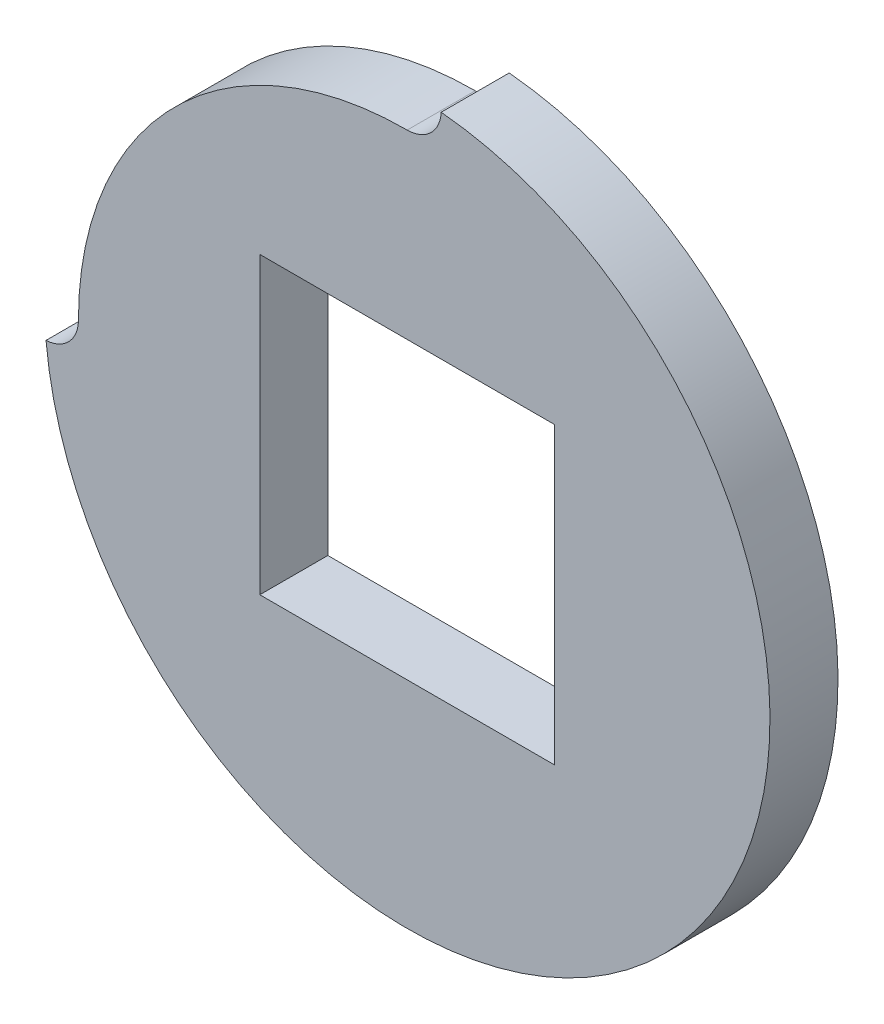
ISO-10303-21;
HEADER;
FILE_DESCRIPTION(('STEP AP214'),'2;1');
FILE_NAME('part.step','',(''),(''),'','','');
FILE_SCHEMA(('AUTOMOTIVE_DESIGN { 1 0 10303 214 1 1 1 1 }'));
ENDSEC;
DATA;
#1=APPLICATION_CONTEXT('core data for automotive mechanical design processes');
#2=APPLICATION_PROTOCOL_DEFINITION('international standard','automotive_design',2000,#1);
#3=PRODUCT_CONTEXT('',#1,'mechanical');
#4=PRODUCT('Part','Part','',(#3));
#5=PRODUCT_RELATED_PRODUCT_CATEGORY('part','',(#4));
#6=PRODUCT_DEFINITION_FORMATION('','',#4);
#7=PRODUCT_DEFINITION_CONTEXT('part definition',#1,'design');
#8=PRODUCT_DEFINITION('design','',#6,#7);
#9=PRODUCT_DEFINITION_SHAPE('','',#8);
#10=(LENGTH_UNIT() NAMED_UNIT(*) SI_UNIT(.MILLI.,.METRE.));
#11=(NAMED_UNIT(*) PLANE_ANGLE_UNIT() SI_UNIT($,.RADIAN.));
#12=(NAMED_UNIT(*) SI_UNIT($,.STERADIAN.) SOLID_ANGLE_UNIT());
#13=UNCERTAINTY_MEASURE_WITH_UNIT(LENGTH_MEASURE(1.E-05),#10,'distance_accuracy_value','');
#14=(GEOMETRIC_REPRESENTATION_CONTEXT(3) GLOBAL_UNCERTAINTY_ASSIGNED_CONTEXT((#13)) GLOBAL_UNIT_ASSIGNED_CONTEXT((#10,
#11,#12)) REPRESENTATION_CONTEXT('',''));
#15=CARTESIAN_POINT('',(0.,0.,0.));
#16=DIRECTION('',(0.,0.,1.));
#17=DIRECTION('',(1.,0.,0.));
#18=AXIS2_PLACEMENT_3D('',#15,#16,#17);
#19=CARTESIAN_POINT('',(0.,8.00000000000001,3.));
#20=DIRECTION('',(0.,0.,1.));
#21=DIRECTION('',(1.,0.,0.));
#22=AXIS2_PLACEMENT_3D('',#19,#20,#21);
#23=PLANE('',#22);
#24=CARTESIAN_POINT('',(0.,16.,3.));
#25=DIRECTION('',(0.,0.,1.));
#26=DIRECTION('',(1.,0.,0.));
#27=AXIS2_PLACEMENT_3D('',#24,#25,#26);
#28=CIRCLE('',#27,1.49999999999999);
#29=CARTESIAN_POINT('',(0.,14.5,3.));
#30=VERTEX_POINT('',#29);
#31=CARTESIAN_POINT('',(1.49835114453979,15.9296875,3.));
#32=VERTEX_POINT('',#31);
#33=EDGE_CURVE('E142',#30,#32,#28,.T.);
#34=ORIENTED_EDGE('',*,*,#33,.F.);
#35=CARTESIAN_POINT('',(0.,0.,3.));
#36=DIRECTION('',(0.,0.,1.));
#37=DIRECTION('',(1.,0.,0.));
#38=AXIS2_PLACEMENT_3D('',#35,#36,#37);
#39=CIRCLE('',#38,14.5);
#40=CARTESIAN_POINT('',(-14.5,0.,3.));
#41=VERTEX_POINT('',#40);
#42=EDGE_CURVE('E151',#30,#41,#39,.T.);
#43=ORIENTED_EDGE('',*,*,#42,.T.);
#44=CARTESIAN_POINT('',(-16.,0.,3.));
#45=DIRECTION('',(0.,0.,1.));
#46=DIRECTION('',(1.,0.,0.));
#47=AXIS2_PLACEMENT_3D('',#44,#45,#46);
#48=CIRCLE('',#47,1.49999999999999);
#49=CARTESIAN_POINT('',(-15.9296875,-1.49835114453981,3.));
#50=VERTEX_POINT('',#49);
#51=EDGE_CURVE('E148',#50,#41,#48,.T.);
#52=ORIENTED_EDGE('',*,*,#51,.F.);
#53=CARTESIAN_POINT('',(0.,0.,3.));
#54=DIRECTION('',(0.,0.,1.));
#55=DIRECTION('',(1.,0.,0.));
#56=AXIS2_PLACEMENT_3D('',#53,#54,#55);
#57=CIRCLE('',#56,16.);
#58=EDGE_CURVE('E145',#50,#32,#57,.T.);
#59=ORIENTED_EDGE('',*,*,#58,.T.);
#60=EDGE_LOOP('',(#34,#43,#52,#59));
#61=FACE_BOUND('',#60,.T.);
#62=DIRECTION('',(-1.,0.,0.));
#63=VECTOR('',#62,1.);
#64=CARTESIAN_POINT('',(6.50000000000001,-6.5,2.99999999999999));
#65=LINE('',#64,#63);
#66=CARTESIAN_POINT('',(6.50000000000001,-6.5,2.99999999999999));
#67=VERTEX_POINT('',#66);
#68=CARTESIAN_POINT('',(-6.50000000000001,-6.50000000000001,2.99999999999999));
#69=VERTEX_POINT('',#68);
#70=EDGE_CURVE('E120',#67,#69,#65,.T.);
#71=ORIENTED_EDGE('',*,*,#70,.T.);
#72=DIRECTION('',(0.,-1.,0.));
#73=VECTOR('',#72,1.);
#74=CARTESIAN_POINT('',(-6.5,6.5,3.));
#75=LINE('',#74,#73);
#76=CARTESIAN_POINT('',(-6.5,6.5,3.));
#77=VERTEX_POINT('',#76);
#78=EDGE_CURVE('E96',#77,#69,#75,.T.);
#79=ORIENTED_EDGE('',*,*,#78,.F.);
#80=DIRECTION('',(1.,0.,0.));
#81=VECTOR('',#80,1.);
#82=CARTESIAN_POINT('',(-6.5,6.5,3.));
#83=LINE('',#82,#81);
#84=CARTESIAN_POINT('',(6.50000000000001,6.50000000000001,3.00000000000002));
#85=VERTEX_POINT('',#84);
#86=EDGE_CURVE('E123',#77,#85,#83,.T.);
#87=ORIENTED_EDGE('',*,*,#86,.T.);
#88=DIRECTION('',(0.,1.,0.));
#89=VECTOR('',#88,1.);
#90=CARTESIAN_POINT('',(6.50000000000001,-6.5,2.99999999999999));
#91=LINE('',#90,#89);
#92=EDGE_CURVE('E45',#67,#85,#91,.T.);
#93=ORIENTED_EDGE('',*,*,#92,.F.);
#94=EDGE_LOOP('',(#71,#79,#87,#93));
#95=FACE_BOUND('',#94,.T.);
#96=ADVANCED_FACE('F30',(#61,#95),#23,.T.);
#97=CARTESIAN_POINT('',(0.,8.00000000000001,0.));
#98=DIRECTION('',(0.,0.,1.));
#99=DIRECTION('',(1.,0.,0.));
#100=AXIS2_PLACEMENT_3D('',#97,#98,#99);
#101=PLANE('',#100);
#102=CARTESIAN_POINT('',(0.,16.,0.));
#103=DIRECTION('',(0.,0.,1.));
#104=DIRECTION('',(1.,0.,0.));
#105=AXIS2_PLACEMENT_3D('',#102,#103,#104);
#106=CIRCLE('',#105,1.49999999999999);
#107=CARTESIAN_POINT('',(0.,14.5,0.));
#108=VERTEX_POINT('',#107);
#109=CARTESIAN_POINT('',(1.49835114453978,15.9296875,0.));
#110=VERTEX_POINT('',#109);
#111=EDGE_CURVE('E100',#108,#110,#106,.T.);
#112=ORIENTED_EDGE('',*,*,#111,.T.);
#113=CARTESIAN_POINT('',(0.,0.,0.));
#114=DIRECTION('',(0.,0.,1.));
#115=DIRECTION('',(1.,0.,0.));
#116=AXIS2_PLACEMENT_3D('',#113,#114,#115);
#117=CIRCLE('',#116,16.);
#118=CARTESIAN_POINT('',(-15.9296875,-1.49835114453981,0.));
#119=VERTEX_POINT('',#118);
#120=EDGE_CURVE('E133',#119,#110,#117,.T.);
#121=ORIENTED_EDGE('',*,*,#120,.F.);
#122=CARTESIAN_POINT('',(-16.,0.,0.));
#123=DIRECTION('',(0.,0.,1.));
#124=DIRECTION('',(1.,0.,0.));
#125=AXIS2_PLACEMENT_3D('',#122,#123,#124);
#126=CIRCLE('',#125,1.49999999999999);
#127=CARTESIAN_POINT('',(-14.5,0.,0.));
#128=VERTEX_POINT('',#127);
#129=EDGE_CURVE('E136',#119,#128,#126,.T.);
#130=ORIENTED_EDGE('',*,*,#129,.T.);
#131=CARTESIAN_POINT('',(0.,0.,0.));
#132=DIRECTION('',(0.,0.,1.));
#133=DIRECTION('',(1.,0.,0.));
#134=AXIS2_PLACEMENT_3D('',#131,#132,#133);
#135=CIRCLE('',#134,14.5);
#136=EDGE_CURVE('E139',#108,#128,#135,.T.);
#137=ORIENTED_EDGE('',*,*,#136,.F.);
#138=EDGE_LOOP('',(#112,#121,#130,#137));
#139=FACE_BOUND('',#138,.T.);
#140=DIRECTION('',(0.,-1.,0.));
#141=VECTOR('',#140,1.);
#142=CARTESIAN_POINT('',(-6.50000000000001,6.5,0.));
#143=LINE('',#142,#141);
#144=CARTESIAN_POINT('',(-6.50000000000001,6.5,0.));
#145=VERTEX_POINT('',#144);
#146=CARTESIAN_POINT('',(-6.50000000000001,-6.50000000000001,0.));
#147=VERTEX_POINT('',#146);
#148=EDGE_CURVE('E53',#145,#147,#143,.T.);
#149=ORIENTED_EDGE('',*,*,#148,.T.);
#150=DIRECTION('',(-1.,0.,0.));
#151=VECTOR('',#150,1.);
#152=CARTESIAN_POINT('',(6.50000000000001,-6.5,0.));
#153=LINE('',#152,#151);
#154=CARTESIAN_POINT('',(6.50000000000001,-6.5,0.));
#155=VERTEX_POINT('',#154);
#156=EDGE_CURVE('E104',#155,#147,#153,.T.);
#157=ORIENTED_EDGE('',*,*,#156,.F.);
#158=DIRECTION('',(0.,1.,0.));
#159=VECTOR('',#158,1.);
#160=CARTESIAN_POINT('',(6.50000000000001,-6.5,0.));
#161=LINE('',#160,#159);
#162=CARTESIAN_POINT('',(6.50000000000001,6.50000000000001,0.));
#163=VERTEX_POINT('',#162);
#164=EDGE_CURVE('E109',#155,#163,#161,.T.);
#165=ORIENTED_EDGE('',*,*,#164,.T.);
#166=DIRECTION('',(1.,0.,0.));
#167=VECTOR('',#166,1.);
#168=CARTESIAN_POINT('',(-6.50000000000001,6.5,0.));
#169=LINE('',#168,#167);
#170=EDGE_CURVE('E114',#145,#163,#169,.T.);
#171=ORIENTED_EDGE('',*,*,#170,.F.);
#172=EDGE_LOOP('',(#149,#157,#165,#171));
#173=FACE_BOUND('',#172,.T.);
#174=ADVANCED_FACE('F112',(#139,#173),#101,.F.);
#175=CARTESIAN_POINT('',(0.,16.,3.));
#176=DIRECTION('',(0.,0.,-1.));
#177=DIRECTION('',(-1.,0.,0.));
#178=AXIS2_PLACEMENT_3D('',#175,#176,#177);
#179=CYLINDRICAL_SURFACE('',#178,1.49999999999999);
#180=DIRECTION('',(0.,0.,-1.));
#181=VECTOR('',#180,1.);
#182=CARTESIAN_POINT('',(0.,14.5,3.));
#183=LINE('',#182,#181);
#184=EDGE_CURVE('E11',#30,#108,#183,.T.);
#185=ORIENTED_EDGE('',*,*,#184,.F.);
#186=ORIENTED_EDGE('',*,*,#33,.T.);
#187=DIRECTION('',(0.,0.,-1.));
#188=VECTOR('',#187,1.);
#189=CARTESIAN_POINT('',(1.49835114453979,15.9296875,3.));
#190=LINE('',#189,#188);
#191=EDGE_CURVE('E154',#32,#110,#190,.T.);
#192=ORIENTED_EDGE('',*,*,#191,.T.);
#193=ORIENTED_EDGE('',*,*,#111,.F.);
#194=EDGE_LOOP('',(#185,#186,#192,#193));
#195=FACE_BOUND('',#194,.T.);
#196=ADVANCED_FACE('F169',(#195),#179,.F.);
#197=CARTESIAN_POINT('',(0.,0.,3.));
#198=DIRECTION('',(0.,0.,-1.));
#199=DIRECTION('',(-1.,0.,0.));
#200=AXIS2_PLACEMENT_3D('',#197,#198,#199);
#201=CYLINDRICAL_SURFACE('',#200,14.5);
#202=DIRECTION('',(0.,0.,-1.));
#203=VECTOR('',#202,1.);
#204=CARTESIAN_POINT('',(-14.5,0.,3.));
#205=LINE('',#204,#203);
#206=EDGE_CURVE('E38',#41,#128,#205,.T.);
#207=ORIENTED_EDGE('',*,*,#206,.F.);
#208=ORIENTED_EDGE('',*,*,#42,.F.);
#209=ORIENTED_EDGE('',*,*,#184,.T.);
#210=ORIENTED_EDGE('',*,*,#136,.T.);
#211=EDGE_LOOP('',(#207,#208,#209,#210));
#212=FACE_BOUND('',#211,.T.);
#213=ADVANCED_FACE('F32',(#212),#201,.T.);
#214=CARTESIAN_POINT('',(-16.,0.,3.));
#215=DIRECTION('',(0.,0.,-1.));
#216=DIRECTION('',(-1.,0.,0.));
#217=AXIS2_PLACEMENT_3D('',#214,#215,#216);
#218=CYLINDRICAL_SURFACE('',#217,1.49999999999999);
#219=DIRECTION('',(0.,0.,-1.));
#220=VECTOR('',#219,1.);
#221=CARTESIAN_POINT('',(-15.9296875,-1.49835114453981,3.));
#222=LINE('',#221,#220);
#223=EDGE_CURVE('E156',#50,#119,#222,.T.);
#224=ORIENTED_EDGE('',*,*,#223,.F.);
#225=ORIENTED_EDGE('',*,*,#51,.T.);
#226=ORIENTED_EDGE('',*,*,#206,.T.);
#227=ORIENTED_EDGE('',*,*,#129,.F.);
#228=EDGE_LOOP('',(#224,#225,#226,#227));
#229=FACE_BOUND('',#228,.T.);
#230=ADVANCED_FACE('F159',(#229),#218,.F.);
#231=CARTESIAN_POINT('',(0.,0.,3.));
#232=DIRECTION('',(0.,0.,-1.));
#233=DIRECTION('',(-1.,0.,0.));
#234=AXIS2_PLACEMENT_3D('',#231,#232,#233);
#235=CYLINDRICAL_SURFACE('',#234,16.);
#236=ORIENTED_EDGE('',*,*,#58,.F.);
#237=ORIENTED_EDGE('',*,*,#223,.T.);
#238=ORIENTED_EDGE('',*,*,#120,.T.);
#239=ORIENTED_EDGE('',*,*,#191,.F.);
#240=EDGE_LOOP('',(#236,#237,#238,#239));
#241=FACE_BOUND('',#240,.T.);
#242=ADVANCED_FACE('F172',(#241),#235,.T.);
#243=CARTESIAN_POINT('',(-6.5,6.5,3.));
#244=DIRECTION('',(1.,0.,0.));
#245=DIRECTION('',(0.,1.,0.));
#246=AXIS2_PLACEMENT_3D('',#243,#244,#245);
#247=PLANE('',#246);
#248=DIRECTION('',(0.,0.,-1.));
#249=VECTOR('',#248,1.);
#250=CARTESIAN_POINT('',(-6.50000000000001,-6.50000000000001,2.99999999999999));
#251=LINE('',#250,#249);
#252=EDGE_CURVE('E92',#69,#147,#251,.T.);
#253=ORIENTED_EDGE('',*,*,#252,.T.);
#254=ORIENTED_EDGE('',*,*,#148,.F.);
#255=DIRECTION('',(0.,0.,-1.));
#256=VECTOR('',#255,1.);
#257=CARTESIAN_POINT('',(-6.5,6.5,3.));
#258=LINE('',#257,#256);
#259=EDGE_CURVE('E126',#77,#145,#258,.T.);
#260=ORIENTED_EDGE('',*,*,#259,.F.);
#261=ORIENTED_EDGE('',*,*,#78,.T.);
#262=EDGE_LOOP('',(#253,#254,#260,#261));
#263=FACE_BOUND('',#262,.T.);
#264=ADVANCED_FACE('F94',(#263),#247,.T.);
#265=CARTESIAN_POINT('',(6.50000000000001,-6.5,2.99999999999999));
#266=DIRECTION('',(0.,-1.,0.));
#267=DIRECTION('',(1.,0.,0.));
#268=AXIS2_PLACEMENT_3D('',#265,#266,#267);
#269=PLANE('',#268);
#270=DIRECTION('',(0.,0.,-1.));
#271=VECTOR('',#270,1.);
#272=CARTESIAN_POINT('',(6.50000000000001,-6.5,2.99999999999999));
#273=LINE('',#272,#271);
#274=EDGE_CURVE('E101',#67,#155,#273,.T.);
#275=ORIENTED_EDGE('',*,*,#274,.T.);
#276=ORIENTED_EDGE('',*,*,#156,.T.);
#277=ORIENTED_EDGE('',*,*,#252,.F.);
#278=ORIENTED_EDGE('',*,*,#70,.F.);
#279=EDGE_LOOP('',(#275,#276,#277,#278));
#280=FACE_BOUND('',#279,.T.);
#281=ADVANCED_FACE('F105',(#280),#269,.F.);
#282=CARTESIAN_POINT('',(6.50000000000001,-6.5,2.99999999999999));
#283=DIRECTION('',(-1.,0.,0.));
#284=DIRECTION('',(0.,-1.,0.));
#285=AXIS2_PLACEMENT_3D('',#282,#283,#284);
#286=PLANE('',#285);
#287=DIRECTION('',(0.,0.,-1.));
#288=VECTOR('',#287,1.);
#289=CARTESIAN_POINT('',(6.50000000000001,6.50000000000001,3.00000000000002));
#290=LINE('',#289,#288);
#291=EDGE_CURVE('E128',#85,#163,#290,.T.);
#292=ORIENTED_EDGE('',*,*,#291,.T.);
#293=ORIENTED_EDGE('',*,*,#164,.F.);
#294=ORIENTED_EDGE('',*,*,#274,.F.);
#295=ORIENTED_EDGE('',*,*,#92,.T.);
#296=EDGE_LOOP('',(#292,#293,#294,#295));
#297=FACE_BOUND('',#296,.T.);
#298=ADVANCED_FACE('F180',(#297),#286,.T.);
#299=CARTESIAN_POINT('',(-6.5,6.5,3.));
#300=DIRECTION('',(0.,1.,0.));
#301=DIRECTION('',(-1.,0.,0.));
#302=AXIS2_PLACEMENT_3D('',#299,#300,#301);
#303=PLANE('',#302);
#304=ORIENTED_EDGE('',*,*,#86,.F.);
#305=ORIENTED_EDGE('',*,*,#259,.T.);
#306=ORIENTED_EDGE('',*,*,#170,.T.);
#307=ORIENTED_EDGE('',*,*,#291,.F.);
#308=EDGE_LOOP('',(#304,#305,#306,#307));
#309=FACE_BOUND('',#308,.T.);
#310=ADVANCED_FACE('F179',(#309),#303,.F.);
#311=CLOSED_SHELL('',(#96,#174,#196,#213,#230,#242,#264,#281,#298,#310));
#312=MANIFOLD_SOLID_BREP('B2',#311);
#313=ADVANCED_BREP_SHAPE_REPRESENTATION('',(#18,#312),#14);
#314=SHAPE_DEFINITION_REPRESENTATION(#9,#313);
ENDSEC;
END-ISO-10303-21;
